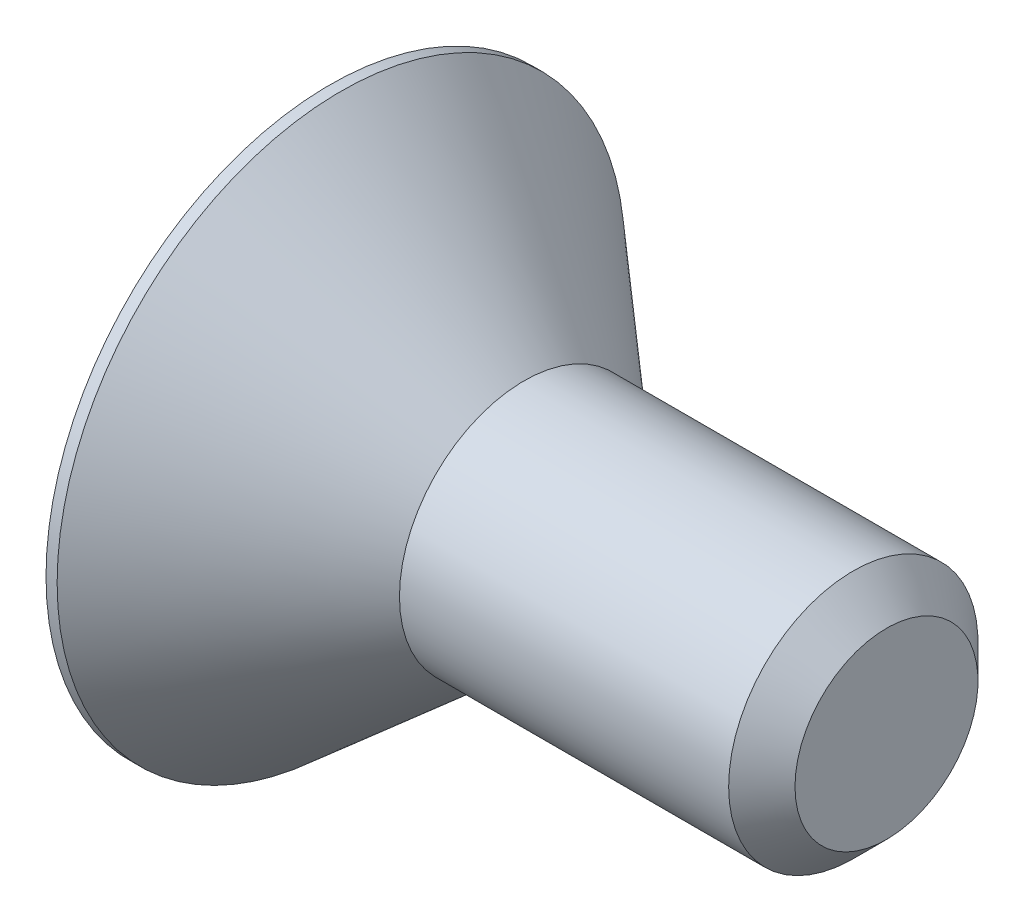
ISO-10303-21;
HEADER;
FILE_DESCRIPTION(('STEP AP214'),'2;1');
FILE_NAME('part.step','',(''),(''),'','','');
FILE_SCHEMA(('AUTOMOTIVE_DESIGN { 1 0 10303 214 1 1 1 1 }'));
ENDSEC;
DATA;
#1=APPLICATION_CONTEXT('core data for automotive mechanical design processes');
#2=APPLICATION_PROTOCOL_DEFINITION('international standard','automotive_design',2000,#1);
#3=PRODUCT_CONTEXT('',#1,'mechanical');
#4=PRODUCT('Part','Part','',(#3));
#5=PRODUCT_RELATED_PRODUCT_CATEGORY('part','',(#4));
#6=PRODUCT_DEFINITION_FORMATION('','',#4);
#7=PRODUCT_DEFINITION_CONTEXT('part definition',#1,'design');
#8=PRODUCT_DEFINITION('design','',#6,#7);
#9=PRODUCT_DEFINITION_SHAPE('','',#8);
#10=(LENGTH_UNIT() NAMED_UNIT(*) SI_UNIT(.MILLI.,.METRE.));
#11=(NAMED_UNIT(*) PLANE_ANGLE_UNIT() SI_UNIT($,.RADIAN.));
#12=(NAMED_UNIT(*) SI_UNIT($,.STERADIAN.) SOLID_ANGLE_UNIT());
#13=UNCERTAINTY_MEASURE_WITH_UNIT(LENGTH_MEASURE(1.E-05),#10,'distance_accuracy_value','');
#14=(GEOMETRIC_REPRESENTATION_CONTEXT(3) GLOBAL_UNCERTAINTY_ASSIGNED_CONTEXT((#13)) GLOBAL_UNIT_ASSIGNED_CONTEXT((#10,
#11,#12)) REPRESENTATION_CONTEXT('',''));
#15=CARTESIAN_POINT('',(0.,0.,0.));
#16=DIRECTION('',(0.,0.,1.));
#17=DIRECTION('',(1.,0.,0.));
#18=AXIS2_PLACEMENT_3D('',#15,#16,#17);
#19=CARTESIAN_POINT('',(0.,0.,0.));
#20=DIRECTION('',(-1.,0.,0.));
#21=DIRECTION('',(0.,0.,1.));
#22=AXIS2_PLACEMENT_3D('',#19,#20,#21);
#23=PLANE('',#22);
#24=CARTESIAN_POINT('',(0.,0.,0.));
#25=DIRECTION('',(-1.,0.,0.));
#26=DIRECTION('',(0.,0.,1.));
#27=AXIS2_PLACEMENT_3D('',#24,#25,#26);
#28=CIRCLE('',#27,3.2385);
#29=CARTESIAN_POINT('',(0.,0.,3.2385));
#30=VERTEX_POINT('',#29);
#31=EDGE_CURVE('E11',#30,#30,#28,.T.);
#32=ORIENTED_EDGE('',*,*,#31,.T.);
#33=EDGE_LOOP('',(#32));
#34=FACE_BOUND('',#33,.T.);
#35=DIRECTION('',(0.,-0.499999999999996,-0.866025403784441));
#36=VECTOR('',#35,1.);
#37=CARTESIAN_POINT('',(0.,-0.458271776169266,0.793749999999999));
#38=LINE('',#37,#36);
#39=CARTESIAN_POINT('',(0.,-0.458271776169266,0.793749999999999));
#40=VERTEX_POINT('',#39);
#41=CARTESIAN_POINT('',(0.,-0.916543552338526,0.));
#42=VERTEX_POINT('',#41);
#43=EDGE_CURVE('E129',#40,#42,#38,.T.);
#44=ORIENTED_EDGE('',*,*,#43,.T.);
#45=DIRECTION('',(0.,0.499999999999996,-0.866025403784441));
#46=VECTOR('',#45,1.);
#47=CARTESIAN_POINT('',(0.,-0.916543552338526,0.));
#48=LINE('',#47,#46);
#49=CARTESIAN_POINT('',(0.,-0.458271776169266,-0.79375));
#50=VERTEX_POINT('',#49);
#51=EDGE_CURVE('E47',#42,#50,#48,.T.);
#52=ORIENTED_EDGE('',*,*,#51,.T.);
#53=DIRECTION('',(0.,1.,0.));
#54=VECTOR('',#53,1.);
#55=CARTESIAN_POINT('',(0.,-0.458271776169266,-0.79375));
#56=LINE('',#55,#54);
#57=CARTESIAN_POINT('',(0.,0.458271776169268,-0.793750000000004));
#58=VERTEX_POINT('',#57);
#59=EDGE_CURVE('E110',#50,#58,#56,.T.);
#60=ORIENTED_EDGE('',*,*,#59,.T.);
#61=DIRECTION('',(0.,0.499999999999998,0.86602540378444));
#62=VECTOR('',#61,1.);
#63=CARTESIAN_POINT('',(0.,0.458271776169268,-0.793750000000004));
#64=LINE('',#63,#62);
#65=CARTESIAN_POINT('',(0.,0.916543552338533,0.));
#66=VERTEX_POINT('',#65);
#67=EDGE_CURVE('E118',#58,#66,#64,.T.);
#68=ORIENTED_EDGE('',*,*,#67,.T.);
#69=DIRECTION('',(0.,-0.5,0.866025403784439));
#70=VECTOR('',#69,1.);
#71=CARTESIAN_POINT('',(0.,0.916543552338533,0.));
#72=LINE('',#71,#70);
#73=CARTESIAN_POINT('',(0.,0.458271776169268,0.79375));
#74=VERTEX_POINT('',#73);
#75=EDGE_CURVE('E133',#66,#74,#72,.T.);
#76=ORIENTED_EDGE('',*,*,#75,.T.);
#77=DIRECTION('',(0.,-1.,0.));
#78=VECTOR('',#77,1.);
#79=CARTESIAN_POINT('',(0.,0.458271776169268,0.79375));
#80=LINE('',#79,#78);
#81=EDGE_CURVE('E136',#74,#40,#80,.T.);
#82=ORIENTED_EDGE('',*,*,#81,.T.);
#83=EDGE_LOOP('',(#44,#52,#60,#68,#76,#82));
#84=FACE_BOUND('',#83,.T.);
#85=ADVANCED_FACE('F33',(#34,#84),#23,.T.);
#86=CARTESIAN_POINT('',(0.,0.,0.));
#87=DIRECTION('',(-1.,0.,0.));
#88=DIRECTION('',(0.,0.,1.));
#89=AXIS2_PLACEMENT_3D('',#86,#87,#88);
#90=CYLINDRICAL_SURFACE('',#89,3.2385);
#91=CARTESIAN_POINT('',(0.126999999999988,0.,0.));
#92=DIRECTION('',(-1.,0.,0.));
#93=DIRECTION('',(0.,0.,1.));
#94=AXIS2_PLACEMENT_3D('',#91,#92,#93);
#95=CIRCLE('',#94,3.2385);
#96=CARTESIAN_POINT('',(0.126999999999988,0.,3.2385));
#97=VERTEX_POINT('',#96);
#98=EDGE_CURVE('E40',#97,#97,#95,.T.);
#99=CARTESIAN_POINT('',(0.126999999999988,0.,3.2385));
#100=CARTESIAN_POINT('',(0.125677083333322,0.,3.2385));
#101=CARTESIAN_POINT('',(0.124354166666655,0.,3.2385));
#102=CARTESIAN_POINT('',(0.121708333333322,0.,3.2385));
#103=CARTESIAN_POINT('',(0.120385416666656,0.,3.2385));
#104=CARTESIAN_POINT('',(0.117739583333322,0.,3.2385));
#105=CARTESIAN_POINT('',(0.116416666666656,0.,3.2385));
#106=CARTESIAN_POINT('',(0.113770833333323,0.,3.2385));
#107=CARTESIAN_POINT('',(0.112447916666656,0.,3.2385));
#108=CARTESIAN_POINT('',(0.109802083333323,0.,3.2385));
#109=CARTESIAN_POINT('',(0.108479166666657,0.,3.2385));
#110=CARTESIAN_POINT('',(0.105833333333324,0.,3.2385));
#111=CARTESIAN_POINT('',(0.104510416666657,0.,3.2385));
#112=CARTESIAN_POINT('',(0.101864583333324,0.,3.2385));
#113=CARTESIAN_POINT('',(0.100541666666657,0.,3.2385));
#114=CARTESIAN_POINT('',(0.0978958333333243,0.,3.2385));
#115=CARTESIAN_POINT('',(0.0965729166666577,0.,3.2385));
#116=CARTESIAN_POINT('',(0.0939270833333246,0.,3.2385));
#117=CARTESIAN_POINT('',(0.0926041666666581,0.,3.2385));
#118=CARTESIAN_POINT('',(0.089958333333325,0.,3.2385));
#119=CARTESIAN_POINT('',(0.0886354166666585,0.,3.2385));
#120=CARTESIAN_POINT('',(0.0859895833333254,0.,3.2385));
#121=CARTESIAN_POINT('',(0.0846666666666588,0.,3.2385));
#122=CARTESIAN_POINT('',(0.0820208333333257,0.,3.2385));
#123=CARTESIAN_POINT('',(0.0806979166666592,0.,3.2385));
#124=CARTESIAN_POINT('',(0.0780520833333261,0.,3.2385));
#125=CARTESIAN_POINT('',(0.0767291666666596,0.,3.2385));
#126=CARTESIAN_POINT('',(0.0740833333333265,0.,3.2385));
#127=CARTESIAN_POINT('',(0.0727604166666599,0.,3.2385));
#128=CARTESIAN_POINT('',(0.0701145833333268,0.,3.2385));
#129=CARTESIAN_POINT('',(0.0687916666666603,0.,3.2385));
#130=CARTESIAN_POINT('',(0.0661458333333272,0.,3.2385));
#131=CARTESIAN_POINT('',(0.0648229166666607,0.,3.2385));
#132=CARTESIAN_POINT('',(0.0621770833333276,0.,3.2385));
#133=CARTESIAN_POINT('',(0.060854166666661,0.,3.2385));
#134=CARTESIAN_POINT('',(0.0582083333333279,0.,3.2385));
#135=CARTESIAN_POINT('',(0.0568854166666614,0.,3.2385));
#136=CARTESIAN_POINT('',(0.0542395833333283,0.,3.2385));
#137=CARTESIAN_POINT('',(0.0529166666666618,0.,3.2385));
#138=CARTESIAN_POINT('',(0.0502708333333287,0.,3.2385));
#139=CARTESIAN_POINT('',(0.0489479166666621,0.,3.2385));
#140=CARTESIAN_POINT('',(0.0463020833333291,0.,3.2385));
#141=CARTESIAN_POINT('',(0.0449791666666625,0.,3.2385));
#142=CARTESIAN_POINT('',(0.0423333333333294,0.,3.2385));
#143=CARTESIAN_POINT('',(0.0410104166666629,0.,3.2385));
#144=CARTESIAN_POINT('',(0.0383645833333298,0.,3.2385));
#145=CARTESIAN_POINT('',(0.0370416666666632,0.,3.2385));
#146=CARTESIAN_POINT('',(0.0343958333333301,0.,3.2385));
#147=CARTESIAN_POINT('',(0.0330729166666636,0.,3.2385));
#148=CARTESIAN_POINT('',(0.0304270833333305,0.,3.2385));
#149=CARTESIAN_POINT('',(0.029104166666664,0.,3.2385));
#150=CARTESIAN_POINT('',(0.0264583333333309,0.,3.2385));
#151=CARTESIAN_POINT('',(0.0251354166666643,0.,3.2385));
#152=CARTESIAN_POINT('',(0.0224895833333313,0.,3.2385));
#153=CARTESIAN_POINT('',(0.0211666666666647,0.,3.2385));
#154=CARTESIAN_POINT('',(0.0185208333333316,0.,3.2385));
#155=CARTESIAN_POINT('',(0.0171979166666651,0.,3.2385));
#156=CARTESIAN_POINT('',(0.014552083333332,0.,3.2385));
#157=CARTESIAN_POINT('',(0.0132291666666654,0.,3.2385));
#158=CARTESIAN_POINT('',(0.0105833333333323,0.,3.2385));
#159=CARTESIAN_POINT('',(0.0092604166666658,0.,3.2385));
#160=CARTESIAN_POINT('',(0.00661458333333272,0.,3.2385));
#161=CARTESIAN_POINT('',(0.00529166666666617,0.,3.2385));
#162=CARTESIAN_POINT('',(0.00264583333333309,0.,3.2385));
#163=CARTESIAN_POINT('',(0.00132291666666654,0.,3.2385));
#164=CARTESIAN_POINT('',(0.,0.,3.2385));
#165=B_SPLINE_CURVE_WITH_KNOTS('',3,(#99,#100,#101,#102,#103,#104,#105,#106,#107,#108,#109,#110,
#111,#112,#113,#114,#115,#116,#117,#118,#119,#120,#121,#122,#123,#124,#125,#126,#127,#128,#129,
#130,#131,#132,#133,#134,#135,#136,#137,#138,#139,#140,#141,#142,#143,#144,#145,#146,#147,#148,
#149,#150,#151,#152,#153,#154,#155,#156,#157,#158,#159,#160,#161,#162,#163,#164),.UNSPECIFIED.,
.F.,.F.,(4,2,2,2,2,2,2,2,2,2,2,2,2,2,2,2,2,2,2,2,2,2,2,2,2,2,2,2,2,2,2,2,4),(0.,
0.00396874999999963,0.00793749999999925,0.0119062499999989,0.0158749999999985,
0.0198437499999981,0.0238124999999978,0.0277812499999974,0.031749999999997,0.0357187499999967,
0.0396874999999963,0.043656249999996,0.0476249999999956,0.0515937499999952,0.0555624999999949,
0.0595312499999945,0.0634999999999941,0.0674687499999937,0.0714374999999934,0.075406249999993,
0.0793749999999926,0.0833437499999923,0.0873124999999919,0.0912812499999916,0.0952499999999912,
0.0992187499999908,0.10318749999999,0.10715624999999,0.11112499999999,0.115093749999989,
0.119062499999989,0.123031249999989,0.126999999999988),.UNSPECIFIED.);
#166=EDGE_CURVE('BSEAM185',#97,#30,#165,.T.);
#167=ORIENTED_EDGE('',*,*,#98,.T.);
#168=ORIENTED_EDGE('',*,*,#31,.F.);
#169=ORIENTED_EDGE('',*,*,#166,.T.);
#170=ORIENTED_EDGE('',*,*,#166,.F.);
#171=EDGE_LOOP('',(#167,#169,#168,#170));
#172=FACE_BOUND('',#171,.T.);
#173=ADVANCED_FACE('F185',(#172),#90,.T.);
#174=CARTESIAN_POINT('',(0.126999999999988,0.,0.));
#175=DIRECTION('',(-1.,0.,0.));
#176=DIRECTION('',(0.,0.,1.));
#177=AXIS2_PLACEMENT_3D('',#174,#175,#176);
#178=CONICAL_SURFACE('',#177,3.2385,0.715584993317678);
#179=CARTESIAN_POINT('',(2.21618406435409,0.,0.));
#180=DIRECTION('',(-1.,0.,0.));
#181=DIRECTION('',(0.,0.,1.));
#182=AXIS2_PLACEMENT_3D('',#179,#180,#181);
#183=CIRCLE('',#182,1.4224);
#184=CARTESIAN_POINT('',(2.21618406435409,0.,1.42239999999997));
#185=VERTEX_POINT('',#184);
#186=EDGE_CURVE('E180',#185,#185,#183,.T.);
#187=CARTESIAN_POINT('',(2.21618406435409,0.,1.42239999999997));
#188=CARTESIAN_POINT('',(2.1944217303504,0.,1.4413177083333));
#189=CARTESIAN_POINT('',(2.17265939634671,0.,1.46023541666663));
#190=CARTESIAN_POINT('',(2.12913472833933,0.,1.4980708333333));
#191=CARTESIAN_POINT('',(2.10737239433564,0.,1.51698854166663));
#192=CARTESIAN_POINT('',(2.06384772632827,0.,1.5548239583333));
#193=CARTESIAN_POINT('',(2.04208539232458,0.,1.57374166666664));
#194=CARTESIAN_POINT('',(1.9985607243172,0.,1.6115770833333));
#195=CARTESIAN_POINT('',(1.97679839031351,0.,1.63049479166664));
#196=CARTESIAN_POINT('',(1.93327372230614,0.,1.6683302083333));
#197=CARTESIAN_POINT('',(1.91151138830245,0.,1.68724791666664));
#198=CARTESIAN_POINT('',(1.86798672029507,0.,1.7250833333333));
#199=CARTESIAN_POINT('',(1.84622438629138,0.,1.74400104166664));
#200=CARTESIAN_POINT('',(1.80269971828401,0.,1.78183645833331));
#201=CARTESIAN_POINT('',(1.78093738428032,0.,1.80075416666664));
#202=CARTESIAN_POINT('',(1.73741271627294,0.,1.83858958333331));
#203=CARTESIAN_POINT('',(1.71565038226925,0.,1.85750729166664));
#204=CARTESIAN_POINT('',(1.67212571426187,0.,1.89534270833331));
#205=CARTESIAN_POINT('',(1.65036338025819,0.,1.91426041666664));
#206=CARTESIAN_POINT('',(1.60683871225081,0.,1.95209583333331));
#207=CARTESIAN_POINT('',(1.58507637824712,0.,1.97101354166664));
#208=CARTESIAN_POINT('',(1.54155171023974,0.,2.00884895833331));
#209=CARTESIAN_POINT('',(1.51978937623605,0.,2.02776666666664));
#210=CARTESIAN_POINT('',(1.47626470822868,0.,2.06560208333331));
#211=CARTESIAN_POINT('',(1.45450237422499,0.,2.08451979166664));
#212=CARTESIAN_POINT('',(1.41097770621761,0.,2.12235520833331));
#213=CARTESIAN_POINT('',(1.38921537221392,0.,2.14127291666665));
#214=CARTESIAN_POINT('',(1.34569070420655,0.,2.17910833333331));
#215=CARTESIAN_POINT('',(1.32392837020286,0.,2.19802604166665));
#216=CARTESIAN_POINT('',(1.28040370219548,0.,2.23586145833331));
#217=CARTESIAN_POINT('',(1.25864136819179,0.,2.25477916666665));
#218=CARTESIAN_POINT('',(1.21511670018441,0.,2.29261458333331));
#219=CARTESIAN_POINT('',(1.19335436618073,0.,2.31153229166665));
#220=CARTESIAN_POINT('',(1.14982969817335,0.,2.34936770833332));
#221=CARTESIAN_POINT('',(1.12806736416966,0.,2.36828541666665));
#222=CARTESIAN_POINT('',(1.08454269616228,0.,2.40612083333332));
#223=CARTESIAN_POINT('',(1.0627803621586,0.,2.42503854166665));
#224=CARTESIAN_POINT('',(1.01925569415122,0.,2.46287395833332));
#225=CARTESIAN_POINT('',(0.99749336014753,0.,2.48179166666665));
#226=CARTESIAN_POINT('',(0.953968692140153,0.,2.51962708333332));
#227=CARTESIAN_POINT('',(0.932206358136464,0.,2.53854479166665));
#228=CARTESIAN_POINT('',(0.888681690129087,0.,2.57638020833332));
#229=CARTESIAN_POINT('',(0.866919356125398,0.,2.59529791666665));
#230=CARTESIAN_POINT('',(0.823394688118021,0.,2.63313333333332));
#231=CARTESIAN_POINT('',(0.801632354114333,0.,2.65205104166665));
#232=CARTESIAN_POINT('',(0.758107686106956,0.,2.68988645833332));
#233=CARTESIAN_POINT('',(0.736345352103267,0.,2.70880416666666));
#234=CARTESIAN_POINT('',(0.69282068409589,0.,2.74663958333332));
#235=CARTESIAN_POINT('',(0.671058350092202,0.,2.76555729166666));
#236=CARTESIAN_POINT('',(0.627533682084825,0.,2.80339270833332));
#237=CARTESIAN_POINT('',(0.605771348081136,0.,2.82231041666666));
#238=CARTESIAN_POINT('',(0.562246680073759,0.,2.86014583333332));
#239=CARTESIAN_POINT('',(0.54048434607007,0.,2.87906354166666));
#240=CARTESIAN_POINT('',(0.496959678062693,0.,2.91689895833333));
#241=CARTESIAN_POINT('',(0.475197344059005,0.,2.93581666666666));
#242=CARTESIAN_POINT('',(0.431672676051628,0.,2.97365208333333));
#243=CARTESIAN_POINT('',(0.409910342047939,0.,2.99256979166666));
#244=CARTESIAN_POINT('',(0.366385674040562,0.,3.03040520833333));
#245=CARTESIAN_POINT('',(0.344623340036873,0.,3.04932291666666));
#246=CARTESIAN_POINT('',(0.301098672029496,0.,3.08715833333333));
#247=CARTESIAN_POINT('',(0.279336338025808,0.,3.10607604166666));
#248=CARTESIAN_POINT('',(0.235811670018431,0.,3.14391145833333));
#249=CARTESIAN_POINT('',(0.214049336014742,0.,3.16282916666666));
#250=CARTESIAN_POINT('',(0.170524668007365,0.,3.20066458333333));
#251=CARTESIAN_POINT('',(0.148762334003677,0.,3.21958229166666));
#252=CARTESIAN_POINT('',(0.126999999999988,0.,3.2385));
#253=B_SPLINE_CURVE_WITH_KNOTS('',3,(#187,#188,#189,#190,#191,#192,#193,#194,#195,#196,#197,
#198,#199,#200,#201,#202,#203,#204,#205,#206,#207,#208,#209,#210,#211,#212,#213,#214,#215,#216,
#217,#218,#219,#220,#221,#222,#223,#224,#225,#226,#227,#228,#229,#230,#231,#232,#233,#234,#235,
#236,#237,#238,#239,#240,#241,#242,#243,#244,#245,#246,#247,#248,#249,#250,#251,#252),
.UNSPECIFIED.,.F.,.F.,(4,2,2,2,2,2,2,2,2,2,2,2,2,2,2,2,2,2,2,2,2,2,2,2,2,2,2,2,2,2,2,2,4),(0.,
0.0865061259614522,0.173012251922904,0.259518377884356,0.346024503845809,0.43253062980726,
0.519036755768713,0.605542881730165,0.692049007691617,0.778555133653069,0.865061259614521,
0.951567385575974,1.03807351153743,1.12457963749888,1.21108576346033,1.29759188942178,
1.38409801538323,1.47060414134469,1.55711026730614,1.64361639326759,1.73012251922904,
1.8166286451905,1.90313477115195,1.9896408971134,2.07614702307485,2.1626531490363,
2.24915927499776,2.33566540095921,2.42217152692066,2.50867765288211,2.59518377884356,
2.68168990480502,2.76819603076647),.UNSPECIFIED.);
#254=EDGE_CURVE('BSEAM188',#185,#97,#253,.T.);
#255=ORIENTED_EDGE('',*,*,#186,.T.);
#256=ORIENTED_EDGE('',*,*,#98,.F.);
#257=ORIENTED_EDGE('',*,*,#254,.T.);
#258=ORIENTED_EDGE('',*,*,#254,.F.);
#259=EDGE_LOOP('',(#255,#257,#256,#258));
#260=FACE_BOUND('',#259,.T.);
#261=ADVANCED_FACE('F188',(#260),#178,.T.);
#262=CARTESIAN_POINT('',(0.,0.,0.));
#263=DIRECTION('',(-1.,0.,0.));
#264=DIRECTION('',(0.,0.,1.));
#265=AXIS2_PLACEMENT_3D('',#262,#263,#264);
#266=CYLINDRICAL_SURFACE('',#265,1.4224);
#267=CARTESIAN_POINT('',(5.97154,0.,0.));
#268=DIRECTION('',(-1.,0.,0.));
#269=DIRECTION('',(0.,0.,1.));
#270=AXIS2_PLACEMENT_3D('',#267,#268,#269);
#271=CIRCLE('',#270,1.4224);
#272=CARTESIAN_POINT('',(5.97154,0.,1.4224));
#273=VERTEX_POINT('',#272);
#274=EDGE_CURVE('E177',#273,#273,#271,.T.);
#275=CARTESIAN_POINT('',(5.97154,0.,1.4224));
#276=CARTESIAN_POINT('',(5.93242170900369,0.,1.4224));
#277=CARTESIAN_POINT('',(5.89330341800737,0.,1.4224));
#278=CARTESIAN_POINT('',(5.81506683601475,0.,1.4224));
#279=CARTESIAN_POINT('',(5.77594854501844,0.,1.4224));
#280=CARTESIAN_POINT('',(5.69771196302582,0.,1.4224));
#281=CARTESIAN_POINT('',(5.6585936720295,0.,1.4224));
#282=CARTESIAN_POINT('',(5.58035709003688,0.,1.4224));
#283=CARTESIAN_POINT('',(5.54123879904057,0.,1.4224));
#284=CARTESIAN_POINT('',(5.46300221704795,0.,1.4224));
#285=CARTESIAN_POINT('',(5.42388392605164,0.,1.4224));
#286=CARTESIAN_POINT('',(5.34564734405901,0.,1.4224));
#287=CARTESIAN_POINT('',(5.3065290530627,0.,1.4224));
#288=CARTESIAN_POINT('',(5.22829247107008,0.,1.4224));
#289=CARTESIAN_POINT('',(5.18917418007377,0.,1.4224));
#290=CARTESIAN_POINT('',(5.11093759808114,0.,1.4224));
#291=CARTESIAN_POINT('',(5.07181930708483,0.,1.4224));
#292=CARTESIAN_POINT('',(4.99358272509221,0.,1.4224));
#293=CARTESIAN_POINT('',(4.9544644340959,0.,1.4224));
#294=CARTESIAN_POINT('',(4.87622785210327,0.,1.4224));
#295=CARTESIAN_POINT('',(4.83710956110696,0.,1.4224));
#296=CARTESIAN_POINT('',(4.75887297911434,0.,1.4224));
#297=CARTESIAN_POINT('',(4.71975468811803,0.,1.4224));
#298=CARTESIAN_POINT('',(4.6415181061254,0.,1.4224));
#299=CARTESIAN_POINT('',(4.60239981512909,0.,1.4224));
#300=CARTESIAN_POINT('',(4.52416323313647,0.,1.4224));
#301=CARTESIAN_POINT('',(4.48504494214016,0.,1.4224));
#302=CARTESIAN_POINT('',(4.40680836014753,0.,1.4224));
#303=CARTESIAN_POINT('',(4.36769006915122,0.,1.4224));
#304=CARTESIAN_POINT('',(4.2894534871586,0.,1.4224));
#305=CARTESIAN_POINT('',(4.25033519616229,0.,1.4224));
#306=CARTESIAN_POINT('',(4.17209861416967,0.,1.4224));
#307=CARTESIAN_POINT('',(4.13298032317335,0.,1.4224));
#308=CARTESIAN_POINT('',(4.05474374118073,0.,1.4224));
#309=CARTESIAN_POINT('',(4.01562545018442,0.,1.4224));
#310=CARTESIAN_POINT('',(3.9373888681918,0.,1.4224));
#311=CARTESIAN_POINT('',(3.89827057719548,0.,1.4224));
#312=CARTESIAN_POINT('',(3.82003399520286,0.,1.4224));
#313=CARTESIAN_POINT('',(3.78091570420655,0.,1.4224));
#314=CARTESIAN_POINT('',(3.70267912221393,0.,1.4224));
#315=CARTESIAN_POINT('',(3.66356083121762,0.,1.4224));
#316=CARTESIAN_POINT('',(3.58532424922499,0.,1.4224));
#317=CARTESIAN_POINT('',(3.54620595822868,0.,1.4224));
#318=CARTESIAN_POINT('',(3.46796937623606,0.,1.4224));
#319=CARTESIAN_POINT('',(3.42885108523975,0.,1.4224));
#320=CARTESIAN_POINT('',(3.35061450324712,0.,1.4224));
#321=CARTESIAN_POINT('',(3.31149621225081,0.,1.4224));
#322=CARTESIAN_POINT('',(3.23325963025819,0.,1.4224));
#323=CARTESIAN_POINT('',(3.19414133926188,0.,1.4224));
#324=CARTESIAN_POINT('',(3.11590475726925,0.,1.4224));
#325=CARTESIAN_POINT('',(3.07678646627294,0.,1.4224));
#326=CARTESIAN_POINT('',(2.99854988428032,0.,1.4224));
#327=CARTESIAN_POINT('',(2.95943159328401,0.,1.4224));
#328=CARTESIAN_POINT('',(2.88119501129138,0.,1.4224));
#329=CARTESIAN_POINT('',(2.84207672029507,0.,1.4224));
#330=CARTESIAN_POINT('',(2.76384013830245,0.,1.4224));
#331=CARTESIAN_POINT('',(2.72472184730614,0.,1.4224));
#332=CARTESIAN_POINT('',(2.64648526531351,0.,1.4224));
#333=CARTESIAN_POINT('',(2.6073669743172,0.,1.4224));
#334=CARTESIAN_POINT('',(2.52913039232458,0.,1.4224));
#335=CARTESIAN_POINT('',(2.49001210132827,0.,1.4224));
#336=CARTESIAN_POINT('',(2.41177551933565,0.,1.4224));
#337=CARTESIAN_POINT('',(2.37265722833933,0.,1.4224));
#338=CARTESIAN_POINT('',(2.29442064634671,0.,1.4224));
#339=CARTESIAN_POINT('',(2.2553023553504,0.,1.4224));
#340=CARTESIAN_POINT('',(2.21618406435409,0.,1.4224));
#341=B_SPLINE_CURVE_WITH_KNOTS('',3,(#275,#276,#277,#278,#279,#280,#281,#282,#283,#284,#285,
#286,#287,#288,#289,#290,#291,#292,#293,#294,#295,#296,#297,#298,#299,#300,#301,#302,#303,#304,
#305,#306,#307,#308,#309,#310,#311,#312,#313,#314,#315,#316,#317,#318,#319,#320,#321,#322,#323,
#324,#325,#326,#327,#328,#329,#330,#331,#332,#333,#334,#335,#336,#337,#338,#339,#340),
.UNSPECIFIED.,.F.,.F.,(4,2,2,2,2,2,2,2,2,2,2,2,2,2,2,2,2,2,2,2,2,2,2,2,2,2,2,2,2,2,2,2,4),(0.,
0.117354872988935,0.234709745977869,0.352064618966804,0.469419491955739,0.586774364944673,
0.704129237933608,0.821484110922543,0.938838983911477,1.05619385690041,1.17354872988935,
1.29090360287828,1.40825847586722,1.52561334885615,1.64296822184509,1.76032309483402,
1.87767796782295,1.99503284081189,2.11238771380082,2.22974258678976,2.34709745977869,
2.46445233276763,2.58180720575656,2.6991620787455,2.81651695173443,2.93387182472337,
3.0512266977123,3.16858157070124,3.28593644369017,3.40329131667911,3.52064618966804,
3.63800106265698,3.75535593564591),.UNSPECIFIED.);
#342=EDGE_CURVE('BSEAM190',#273,#185,#341,.T.);
#343=ORIENTED_EDGE('',*,*,#274,.T.);
#344=ORIENTED_EDGE('',*,*,#186,.F.);
#345=ORIENTED_EDGE('',*,*,#342,.T.);
#346=ORIENTED_EDGE('',*,*,#342,.F.);
#347=EDGE_LOOP('',(#343,#345,#344,#346));
#348=FACE_BOUND('',#347,.T.);
#349=ADVANCED_FACE('F190',(#348),#266,.T.);
#350=CARTESIAN_POINT('',(6.34999999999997,0.,0.));
#351=DIRECTION('',(-1.,0.,0.));
#352=DIRECTION('',(0.,0.,1.));
#353=AXIS2_PLACEMENT_3D('',#350,#351,#352);
#354=CONICAL_SURFACE('',#353,1.04394,0.785398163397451);
#355=CARTESIAN_POINT('',(6.34999999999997,0.,0.));
#356=DIRECTION('',(-1.,0.,0.));
#357=DIRECTION('',(0.,0.,1.));
#358=AXIS2_PLACEMENT_3D('',#355,#356,#357);
#359=CIRCLE('',#358,1.04394);
#360=CARTESIAN_POINT('',(6.34999999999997,0.,1.04394));
#361=VERTEX_POINT('',#360);
#362=EDGE_CURVE('E173',#361,#361,#359,.T.);
#363=CARTESIAN_POINT('',(5.97154,0.,1.42239999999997));
#364=CARTESIAN_POINT('',(5.97548229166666,0.,1.41845770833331));
#365=CARTESIAN_POINT('',(5.97942458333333,0.,1.41451541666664));
#366=CARTESIAN_POINT('',(5.98730916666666,0.,1.40663083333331));
#367=CARTESIAN_POINT('',(5.99125145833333,0.,1.40268854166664));
#368=CARTESIAN_POINT('',(5.99913604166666,0.,1.39480395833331));
#369=CARTESIAN_POINT('',(6.00307833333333,0.,1.39086166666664));
#370=CARTESIAN_POINT('',(6.01096291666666,0.,1.38297708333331));
#371=CARTESIAN_POINT('',(6.01490520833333,0.,1.37903479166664));
#372=CARTESIAN_POINT('',(6.02278979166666,0.,1.37115020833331));
#373=CARTESIAN_POINT('',(6.02673208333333,0.,1.36720791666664));
#374=CARTESIAN_POINT('',(6.03461666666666,0.,1.35932333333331));
#375=CARTESIAN_POINT('',(6.03855895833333,0.,1.35538104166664));
#376=CARTESIAN_POINT('',(6.04644354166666,0.,1.34749645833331));
#377=CARTESIAN_POINT('',(6.05038583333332,0.,1.34355416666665));
#378=CARTESIAN_POINT('',(6.05827041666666,0.,1.33566958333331));
#379=CARTESIAN_POINT('',(6.06221270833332,0.,1.33172729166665));
#380=CARTESIAN_POINT('',(6.07009729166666,0.,1.32384270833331));
#381=CARTESIAN_POINT('',(6.07403958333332,0.,1.31990041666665));
#382=CARTESIAN_POINT('',(6.08192416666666,0.,1.31201583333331));
#383=CARTESIAN_POINT('',(6.08586645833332,0.,1.30807354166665));
#384=CARTESIAN_POINT('',(6.09375104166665,0.,1.30018895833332));
#385=CARTESIAN_POINT('',(6.09769333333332,0.,1.29624666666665));
#386=CARTESIAN_POINT('',(6.10557791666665,0.,1.28836208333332));
#387=CARTESIAN_POINT('',(6.10952020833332,0.,1.28441979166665));
#388=CARTESIAN_POINT('',(6.11740479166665,0.,1.27653520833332));
#389=CARTESIAN_POINT('',(6.12134708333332,0.,1.27259291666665));
#390=CARTESIAN_POINT('',(6.12923166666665,0.,1.26470833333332));
#391=CARTESIAN_POINT('',(6.13317395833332,0.,1.26076604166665));
#392=CARTESIAN_POINT('',(6.14105854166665,0.,1.25288145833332));
#393=CARTESIAN_POINT('',(6.14500083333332,0.,1.24893916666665));
#394=CARTESIAN_POINT('',(6.15288541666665,0.,1.24105458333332));
#395=CARTESIAN_POINT('',(6.15682770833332,0.,1.23711229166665));
#396=CARTESIAN_POINT('',(6.16471229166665,0.,1.22922770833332));
#397=CARTESIAN_POINT('',(6.16865458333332,0.,1.22528541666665));
#398=CARTESIAN_POINT('',(6.17653916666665,0.,1.21740083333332));
#399=CARTESIAN_POINT('',(6.18048145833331,0.,1.21345854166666));
#400=CARTESIAN_POINT('',(6.18836604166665,0.,1.20557395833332));
#401=CARTESIAN_POINT('',(6.19230833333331,0.,1.20163166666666));
#402=CARTESIAN_POINT('',(6.20019291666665,0.,1.19374708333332));
#403=CARTESIAN_POINT('',(6.20413520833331,0.,1.18980479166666));
#404=CARTESIAN_POINT('',(6.21201979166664,0.,1.18192020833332));
#405=CARTESIAN_POINT('',(6.21596208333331,0.,1.17797791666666));
#406=CARTESIAN_POINT('',(6.22384666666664,0.,1.17009333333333));
#407=CARTESIAN_POINT('',(6.22778895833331,0.,1.16615104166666));
#408=CARTESIAN_POINT('',(6.23567354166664,0.,1.15826645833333));
#409=CARTESIAN_POINT('',(6.23961583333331,0.,1.15432416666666));
#410=CARTESIAN_POINT('',(6.24750041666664,0.,1.14643958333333));
#411=CARTESIAN_POINT('',(6.25144270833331,0.,1.14249729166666));
#412=CARTESIAN_POINT('',(6.25932729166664,0.,1.13461270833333));
#413=CARTESIAN_POINT('',(6.26326958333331,0.,1.13067041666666));
#414=CARTESIAN_POINT('',(6.27115416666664,0.,1.12278583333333));
#415=CARTESIAN_POINT('',(6.27509645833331,0.,1.11884354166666));
#416=CARTESIAN_POINT('',(6.28298104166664,0.,1.11095895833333));
#417=CARTESIAN_POINT('',(6.28692333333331,0.,1.10701666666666));
#418=CARTESIAN_POINT('',(6.29480791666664,0.,1.09913208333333));
#419=CARTESIAN_POINT('',(6.29875020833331,0.,1.09518979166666));
#420=CARTESIAN_POINT('',(6.30663479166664,0.,1.08730520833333));
#421=CARTESIAN_POINT('',(6.3105770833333,0.,1.08336291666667));
#422=CARTESIAN_POINT('',(6.31846166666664,0.,1.07547833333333));
#423=CARTESIAN_POINT('',(6.3224039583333,0.,1.07153604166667));
#424=CARTESIAN_POINT('',(6.33028854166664,0.,1.06365145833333));
#425=CARTESIAN_POINT('',(6.3342308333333,0.,1.05970916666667));
#426=CARTESIAN_POINT('',(6.34211541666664,0.,1.05182458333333));
#427=CARTESIAN_POINT('',(6.3460577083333,0.,1.04788229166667));
#428=CARTESIAN_POINT('',(6.34999999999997,0.,1.04394));
#429=B_SPLINE_CURVE_WITH_KNOTS('',3,(#363,#364,#365,#366,#367,#368,#369,#370,#371,#372,#373,
#374,#375,#376,#377,#378,#379,#380,#381,#382,#383,#384,#385,#386,#387,#388,#389,#390,#391,#392,
#393,#394,#395,#396,#397,#398,#399,#400,#401,#402,#403,#404,#405,#406,#407,#408,#409,#410,#411,
#412,#413,#414,#415,#416,#417,#418,#419,#420,#421,#422,#423,#424,#425,#426,#427,#428),
.UNSPECIFIED.,.F.,.F.,(4,2,2,2,2,2,2,2,2,2,2,2,2,2,2,2,2,2,2,2,2,2,2,2,2,2,2,2,2,2,2,2,4),(0.,
0.0167257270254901,0.03345145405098,0.05017718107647,0.0669029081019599,0.08362863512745,
0.10035436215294,0.11708008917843,0.13380581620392,0.15053154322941,0.1672572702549,
0.18398299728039,0.200708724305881,0.217434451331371,0.234160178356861,0.25088590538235,
0.26761163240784,0.28433735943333,0.30106308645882,0.31778881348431,0.3345145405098,
0.35124026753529,0.36796599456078,0.38469172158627,0.40141744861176,0.41814317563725,
0.43486890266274,0.45159462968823,0.46832035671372,0.48504608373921,0.5017718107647,
0.51849753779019,0.53522326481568),.UNSPECIFIED.);
#430=EDGE_CURVE('BSEAM197',#273,#361,#429,.T.);
#431=ORIENTED_EDGE('',*,*,#274,.F.);
#432=ORIENTED_EDGE('',*,*,#362,.T.);
#433=ORIENTED_EDGE('',*,*,#430,.T.);
#434=ORIENTED_EDGE('',*,*,#430,.F.);
#435=EDGE_LOOP('',(#431,#433,#432,#434));
#436=FACE_BOUND('',#435,.T.);
#437=ADVANCED_FACE('F197',(#436),#354,.T.);
#438=CARTESIAN_POINT('',(6.34999999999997,1.04394,0.));
#439=DIRECTION('',(1.,0.,0.));
#440=DIRECTION('',(0.,0.,-1.));
#441=AXIS2_PLACEMENT_3D('',#438,#439,#440);
#442=PLANE('',#441);
#443=ORIENTED_EDGE('',*,*,#362,.F.);
#444=EDGE_LOOP('',(#443));
#445=FACE_BOUND('',#444,.T.);
#446=ADVANCED_FACE('F228',(#445),#442,.T.);
#447=CARTESIAN_POINT('',(1.39699999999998,-0.916543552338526,0.));
#448=DIRECTION('',(0.,0.866025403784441,0.499999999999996));
#449=DIRECTION('',(0.,-0.499999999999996,0.866025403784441));
#450=AXIS2_PLACEMENT_3D('',#447,#448,#449);
#451=PLANE('',#450);
#452=ORIENTED_EDGE('',*,*,#51,.F.);
#453=DIRECTION('',(-1.,0.,0.));
#454=VECTOR('',#453,1.);
#455=CARTESIAN_POINT('',(1.39699999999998,-0.916543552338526,0.));
#456=LINE('',#455,#454);
#457=CARTESIAN_POINT('',(1.39699999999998,-0.916543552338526,0.));
#458=VERTEX_POINT('',#457);
#459=EDGE_CURVE('E158',#458,#42,#456,.T.);
#460=ORIENTED_EDGE('',*,*,#459,.F.);
#461=DIRECTION('',(0.,0.499999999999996,-0.866025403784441));
#462=VECTOR('',#461,1.);
#463=CARTESIAN_POINT('',(1.39699999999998,-0.916543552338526,0.));
#464=LINE('',#463,#462);
#465=CARTESIAN_POINT('',(1.39699999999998,-0.687407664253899,-0.396874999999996));
#466=VERTEX_POINT('',#465);
#467=EDGE_CURVE('E139',#458,#466,#464,.T.);
#468=ORIENTED_EDGE('',*,*,#467,.T.);
#469=CARTESIAN_POINT('',(1.39699999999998,-0.458271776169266,-0.793750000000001));
#470=VERTEX_POINT('',#469);
#471=EDGE_CURVE('E123',#466,#470,#464,.T.);
#472=ORIENTED_EDGE('',*,*,#471,.T.);
#473=DIRECTION('',(-1.,0.,0.));
#474=VECTOR('',#473,1.);
#475=CARTESIAN_POINT('',(1.39699999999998,-0.458271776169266,-0.793750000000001));
#476=LINE('',#475,#474);
#477=EDGE_CURVE('E113',#470,#50,#476,.T.);
#478=ORIENTED_EDGE('',*,*,#477,.T.);
#479=EDGE_LOOP('',(#452,#460,#468,#472,#478));
#480=FACE_BOUND('',#479,.T.);
#481=ADVANCED_FACE('F120',(#480),#451,.T.);
#482=CARTESIAN_POINT('',(1.39699999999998,-0.458271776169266,-0.793750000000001));
#483=DIRECTION('',(0.,0.,1.));
#484=DIRECTION('',(0.,-1.,0.));
#485=AXIS2_PLACEMENT_3D('',#482,#483,#484);
#486=PLANE('',#485);
#487=ORIENTED_EDGE('',*,*,#59,.F.);
#488=ORIENTED_EDGE('',*,*,#477,.F.);
#489=DIRECTION('',(0.,1.,0.));
#490=VECTOR('',#489,1.);
#491=CARTESIAN_POINT('',(1.39699999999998,-0.458271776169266,-0.793750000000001));
#492=LINE('',#491,#490);
#493=CARTESIAN_POINT('',(1.39699999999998,0.,-0.793750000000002));
#494=VERTEX_POINT('',#493);
#495=EDGE_CURVE('E142',#470,#494,#492,.T.);
#496=ORIENTED_EDGE('',*,*,#495,.T.);
#497=CARTESIAN_POINT('',(1.39699999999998,0.458271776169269,-0.793750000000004));
#498=VERTEX_POINT('',#497);
#499=EDGE_CURVE('E141',#494,#498,#492,.T.);
#500=ORIENTED_EDGE('',*,*,#499,.T.);
#501=DIRECTION('',(-1.,0.,0.));
#502=VECTOR('',#501,1.);
#503=CARTESIAN_POINT('',(1.39699999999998,0.458271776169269,-0.793750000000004));
#504=LINE('',#503,#502);
#505=EDGE_CURVE('E115',#498,#58,#504,.T.);
#506=ORIENTED_EDGE('',*,*,#505,.T.);
#507=EDGE_LOOP('',(#487,#488,#496,#500,#506));
#508=FACE_BOUND('',#507,.T.);
#509=ADVANCED_FACE('F111',(#508),#486,.T.);
#510=CARTESIAN_POINT('',(1.39699999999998,0.458271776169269,-0.793750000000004));
#511=DIRECTION('',(0.,-0.86602540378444,0.499999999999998));
#512=DIRECTION('',(0.,-0.499999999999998,-0.86602540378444));
#513=AXIS2_PLACEMENT_3D('',#510,#511,#512);
#514=PLANE('',#513);
#515=ORIENTED_EDGE('',*,*,#67,.F.);
#516=ORIENTED_EDGE('',*,*,#505,.F.);
#517=DIRECTION('',(0.,0.499999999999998,0.86602540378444));
#518=VECTOR('',#517,1.);
#519=CARTESIAN_POINT('',(1.39699999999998,0.458271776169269,-0.793750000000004));
#520=LINE('',#519,#518);
#521=CARTESIAN_POINT('',(1.39699999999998,0.687407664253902,-0.396875));
#522=VERTEX_POINT('',#521);
#523=EDGE_CURVE('E145',#498,#522,#520,.T.);
#524=ORIENTED_EDGE('',*,*,#523,.T.);
#525=CARTESIAN_POINT('',(1.39699999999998,0.916543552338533,0.));
#526=VERTEX_POINT('',#525);
#527=EDGE_CURVE('E144',#522,#526,#520,.T.);
#528=ORIENTED_EDGE('',*,*,#527,.T.);
#529=DIRECTION('',(-1.,0.,0.));
#530=VECTOR('',#529,1.);
#531=CARTESIAN_POINT('',(1.39699999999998,0.916543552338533,0.));
#532=LINE('',#531,#530);
#533=EDGE_CURVE('E166',#526,#66,#532,.T.);
#534=ORIENTED_EDGE('',*,*,#533,.T.);
#535=EDGE_LOOP('',(#515,#516,#524,#528,#534));
#536=FACE_BOUND('',#535,.T.);
#537=ADVANCED_FACE('F256',(#536),#514,.T.);
#538=CARTESIAN_POINT('',(1.39699999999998,0.916543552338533,0.));
#539=DIRECTION('',(0.,-0.866025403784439,-0.5));
#540=DIRECTION('',(0.,0.5,-0.866025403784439));
#541=AXIS2_PLACEMENT_3D('',#538,#539,#540);
#542=PLANE('',#541);
#543=ORIENTED_EDGE('',*,*,#75,.F.);
#544=ORIENTED_EDGE('',*,*,#533,.F.);
#545=DIRECTION('',(0.,-0.5,0.866025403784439));
#546=VECTOR('',#545,1.);
#547=CARTESIAN_POINT('',(1.39699999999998,0.916543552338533,0.));
#548=LINE('',#547,#546);
#549=CARTESIAN_POINT('',(1.39699999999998,0.687407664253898,0.396874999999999));
#550=VERTEX_POINT('',#549);
#551=EDGE_CURVE('E55',#526,#550,#548,.T.);
#552=ORIENTED_EDGE('',*,*,#551,.T.);
#553=CARTESIAN_POINT('',(1.39699999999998,0.458271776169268,0.793749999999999));
#554=VERTEX_POINT('',#553);
#555=EDGE_CURVE('E148',#550,#554,#548,.T.);
#556=ORIENTED_EDGE('',*,*,#555,.T.);
#557=DIRECTION('',(-1.,0.,0.));
#558=VECTOR('',#557,1.);
#559=CARTESIAN_POINT('',(1.39699999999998,0.458271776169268,0.793749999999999));
#560=LINE('',#559,#558);
#561=EDGE_CURVE('E163',#554,#74,#560,.T.);
#562=ORIENTED_EDGE('',*,*,#561,.T.);
#563=EDGE_LOOP('',(#543,#544,#552,#556,#562));
#564=FACE_BOUND('',#563,.T.);
#565=ADVANCED_FACE('F265',(#564),#542,.T.);
#566=CARTESIAN_POINT('',(1.39699999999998,0.458271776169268,0.793749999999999));
#567=DIRECTION('',(0.,0.,-1.));
#568=DIRECTION('',(-1.,0.,0.));
#569=AXIS2_PLACEMENT_3D('',#566,#567,#568);
#570=PLANE('',#569);
#571=ORIENTED_EDGE('',*,*,#81,.F.);
#572=ORIENTED_EDGE('',*,*,#561,.F.);
#573=DIRECTION('',(0.,-1.,0.));
#574=VECTOR('',#573,1.);
#575=CARTESIAN_POINT('',(1.39699999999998,0.458271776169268,0.793749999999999));
#576=LINE('',#575,#574);
#577=CARTESIAN_POINT('',(1.39699999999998,0.,0.793749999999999));
#578=VERTEX_POINT('',#577);
#579=EDGE_CURVE('E151',#554,#578,#576,.T.);
#580=ORIENTED_EDGE('',*,*,#579,.T.);
#581=CARTESIAN_POINT('',(1.39699999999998,-0.458271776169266,0.793749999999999));
#582=VERTEX_POINT('',#581);
#583=EDGE_CURVE('E150',#578,#582,#576,.T.);
#584=ORIENTED_EDGE('',*,*,#583,.T.);
#585=DIRECTION('',(-1.,0.,0.));
#586=VECTOR('',#585,1.);
#587=CARTESIAN_POINT('',(1.39699999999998,-0.458271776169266,0.793749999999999));
#588=LINE('',#587,#586);
#589=EDGE_CURVE('E160',#582,#40,#588,.T.);
#590=ORIENTED_EDGE('',*,*,#589,.T.);
#591=EDGE_LOOP('',(#571,#572,#580,#584,#590));
#592=FACE_BOUND('',#591,.T.);
#593=ADVANCED_FACE('F275',(#592),#570,.T.);
#594=CARTESIAN_POINT('',(1.39699999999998,-0.458271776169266,0.793749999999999));
#595=DIRECTION('',(0.,0.866025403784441,-0.499999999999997));
#596=DIRECTION('',(0.,0.499999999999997,0.866025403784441));
#597=AXIS2_PLACEMENT_3D('',#594,#595,#596);
#598=PLANE('',#597);
#599=ORIENTED_EDGE('',*,*,#43,.F.);
#600=ORIENTED_EDGE('',*,*,#589,.F.);
#601=DIRECTION('',(0.,-0.499999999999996,-0.866025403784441));
#602=VECTOR('',#601,1.);
#603=CARTESIAN_POINT('',(1.39699999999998,-0.458271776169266,0.793749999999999));
#604=LINE('',#603,#602);
#605=CARTESIAN_POINT('',(1.39699999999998,-0.687407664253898,0.396874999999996));
#606=VERTEX_POINT('',#605);
#607=EDGE_CURVE('E155',#582,#606,#604,.T.);
#608=ORIENTED_EDGE('',*,*,#607,.T.);
#609=EDGE_CURVE('E154',#606,#458,#604,.T.);
#610=ORIENTED_EDGE('',*,*,#609,.T.);
#611=ORIENTED_EDGE('',*,*,#459,.T.);
#612=EDGE_LOOP('',(#599,#600,#608,#610,#611));
#613=FACE_BOUND('',#612,.T.);
#614=ADVANCED_FACE('F284',(#613),#598,.T.);
#615=CARTESIAN_POINT('',(1.39699999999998,-1.37481532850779,0.793749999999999));
#616=DIRECTION('',(-1.,0.,0.));
#617=DIRECTION('',(0.,0.,1.));
#618=AXIS2_PLACEMENT_3D('',#615,#616,#617);
#619=PLANE('',#618);
#620=CARTESIAN_POINT('',(1.39699999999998,0.,0.));
#621=DIRECTION('',(-1.,0.,0.));
#622=DIRECTION('',(0.,0.,1.));
#623=AXIS2_PLACEMENT_3D('',#620,#621,#622);
#624=CIRCLE('',#623,0.793749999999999);
#625=EDGE_CURVE('E125',#606,#578,#624,.T.);
#626=ORIENTED_EDGE('',*,*,#625,.F.);
#627=ORIENTED_EDGE('',*,*,#607,.F.);
#628=ORIENTED_EDGE('',*,*,#583,.F.);
#629=EDGE_LOOP('',(#626,#627,#628));
#630=FACE_BOUND('',#629,.T.);
#631=ADVANCED_FACE('F294',(#630),#619,.T.);
#632=EDGE_CURVE('E381',#466,#606,#624,.T.);
#633=ORIENTED_EDGE('',*,*,#632,.F.);
#634=ORIENTED_EDGE('',*,*,#467,.F.);
#635=ORIENTED_EDGE('',*,*,#609,.F.);
#636=EDGE_LOOP('',(#633,#634,#635));
#637=FACE_BOUND('',#636,.T.);
#638=ADVANCED_FACE('F304',(#637),#619,.T.);
#639=EDGE_CURVE('E379',#494,#466,#624,.T.);
#640=ORIENTED_EDGE('',*,*,#639,.F.);
#641=ORIENTED_EDGE('',*,*,#495,.F.);
#642=ORIENTED_EDGE('',*,*,#471,.F.);
#643=EDGE_LOOP('',(#640,#641,#642));
#644=FACE_BOUND('',#643,.T.);
#645=ADVANCED_FACE('F315',(#644),#619,.T.);
#646=EDGE_CURVE('E378',#522,#494,#624,.T.);
#647=ORIENTED_EDGE('',*,*,#646,.F.);
#648=ORIENTED_EDGE('',*,*,#523,.F.);
#649=ORIENTED_EDGE('',*,*,#499,.F.);
#650=EDGE_LOOP('',(#647,#648,#649));
#651=FACE_BOUND('',#650,.T.);
#652=ADVANCED_FACE('F324',(#651),#619,.T.);
#653=EDGE_CURVE('E174',#550,#522,#624,.T.);
#654=ORIENTED_EDGE('',*,*,#653,.F.);
#655=ORIENTED_EDGE('',*,*,#551,.F.);
#656=ORIENTED_EDGE('',*,*,#527,.F.);
#657=EDGE_LOOP('',(#654,#655,#656));
#658=FACE_BOUND('',#657,.T.);
#659=ADVANCED_FACE('F333',(#658),#619,.T.);
#660=EDGE_CURVE('E170',#578,#550,#624,.T.);
#661=ORIENTED_EDGE('',*,*,#660,.F.);
#662=ORIENTED_EDGE('',*,*,#579,.F.);
#663=ORIENTED_EDGE('',*,*,#555,.F.);
#664=EDGE_LOOP('',(#661,#662,#663));
#665=FACE_BOUND('',#664,.T.);
#666=ADVANCED_FACE('F307',(#665),#619,.T.);
#667=CARTESIAN_POINT('',(1.39699999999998,0.,0.));
#668=DIRECTION('',(-1.,0.,0.));
#669=DIRECTION('',(0.,0.,1.));
#670=AXIS2_PLACEMENT_3D('',#667,#668,#669);
#671=CONICAL_SURFACE('',#670,0.793749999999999,1.04719755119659);
#672=CARTESIAN_POINT('',(1.85527177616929,0.,0.));
#673=VERTEX_POINT('',#672);
#674=VERTEX_LOOP('',#673);
#675=FACE_BOUND('',#674,.T.);
#676=ORIENTED_EDGE('',*,*,#660,.T.);
#677=ORIENTED_EDGE('',*,*,#653,.T.);
#678=ORIENTED_EDGE('',*,*,#646,.T.);
#679=ORIENTED_EDGE('',*,*,#639,.T.);
#680=ORIENTED_EDGE('',*,*,#632,.T.);
#681=ORIENTED_EDGE('',*,*,#625,.T.);
#682=EDGE_LOOP('',(#676,#677,#678,#679,#680,#681));
#683=FACE_BOUND('',#682,.T.);
#684=ADVANCED_FACE('F350',(#675,#683),#671,.F.);
#685=CLOSED_SHELL('',(#85,#173,#261,#349,#437,#446,#481,#509,#537,#565,#593,#614,#631,#638,#645,
#652,#659,#666,#684));
#686=MANIFOLD_SOLID_BREP('B2',#685);
#687=ADVANCED_BREP_SHAPE_REPRESENTATION('',(#18,#686),#14);
#688=SHAPE_DEFINITION_REPRESENTATION(#9,#687);
ENDSEC;
END-ISO-10303-21;
